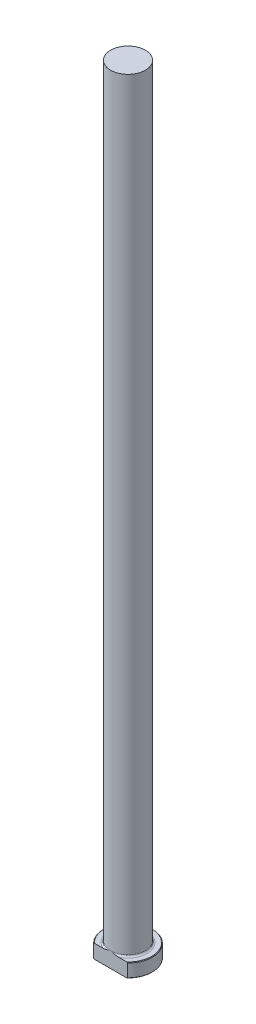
from build123d import *

# Parameters (mm, degrees)
CHAMFER1_SIZE = 0.254
FILLET1_R     = 0.762
KEY_DEPTH     = 356.947096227


with BuildPart() as part:
    # Sketch1 → Revolve1 (revolve)
    with BuildSketch(Plane.XY, mode=Mode.PRIVATE) as revolve1_sk:
        Polygon((0, 0), (-11.1125, 0), (-11.1125, 6.35), (-7.9375, 6.35), (-7.9375, 355.6), (0, 355.6), align=None)
    revolve(revolve1_sk.sketch.rotate(Axis((0, 259.958771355, 0), (0, -1, 0)), 270), axis=Axis((0, 259.958771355, 0), (0, -1, 0)))

    # Chamfer1
    chamfer1_edges = [part.edges().sort_by_distance(p)[0] for p in [
        (0, 6.35, -11.1125),
        (0, 0, -11.1125),
    ]]
    chamfer(chamfer1_edges, length=CHAMFER1_SIZE)

    # Fillet1
    fillet1_edges = [part.edges().sort_by_distance(p)[0] for p in [
        (0, 6.35, -7.9375),
    ]]
    fillet(fillet1_edges, radius=FILLET1_R)

    # Sketch2 → KEY (cut, through all)
    with BuildSketch(Plane.XZ):
        with BuildLine():
            Line((-7.777129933, 7.9375), (7.777129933, 7.9375))
            ThreePointArc((7.777129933, 7.9375), (0, 11.1125), (-7.777129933, 7.9375))
        make_face()
    extrude(amount=-KEY_DEPTH, mode=Mode.SUBTRACT)


solid = part.part
